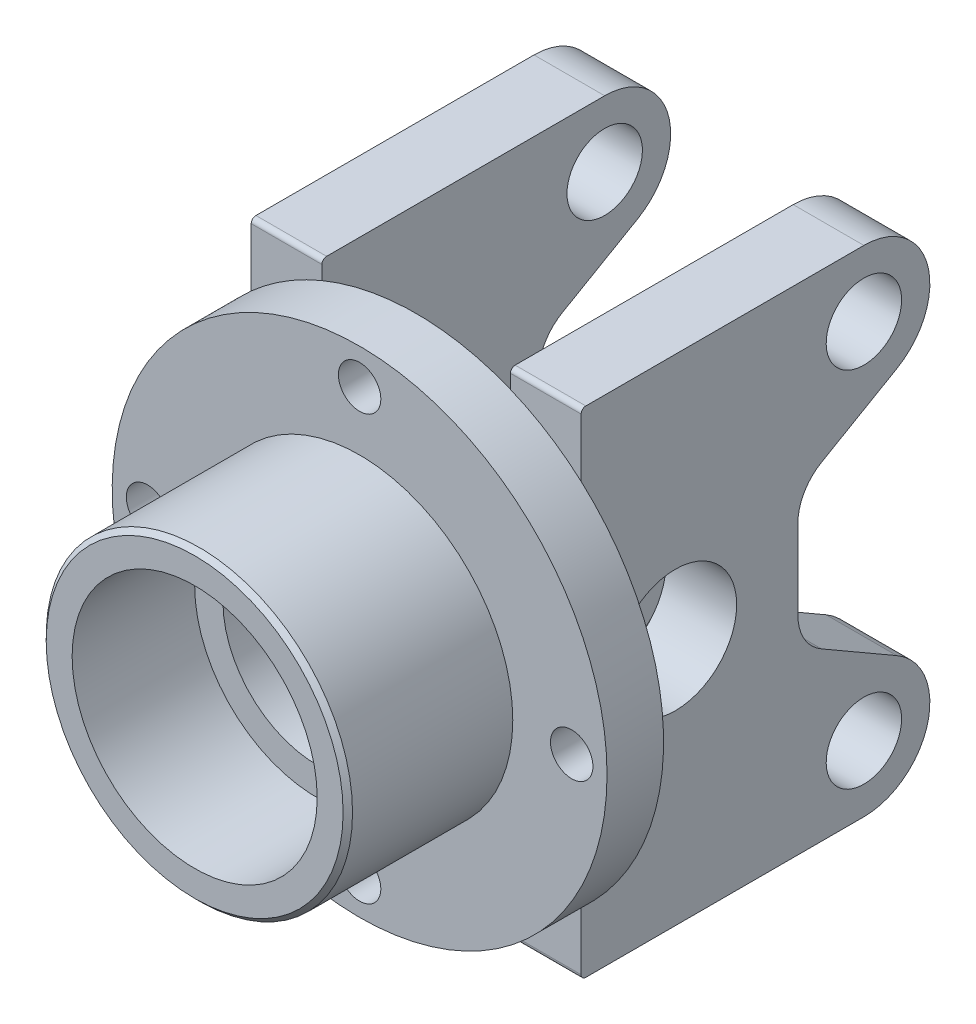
from build123d import *

# Parameters (mm, degrees)
SKETCH_10_R          = 52.5
SKETCH_10_R_2        = 32.5
EXTRUDE_5_DEPTH      = 12
SKETCH_10_3_R        = 32.5
EXTRUDE_6_DEPTH      = 47
SKETCH_11_R          = 26
CUT_EXTRUDE_11_DEPTH = 26
SKETCH_12_R          = 20
CUT_EXTRUDE_12_DEPTH = 21
SKETCH_13_R          = 4.5
CUT_EXTRUDE_13_DEPTH = 88.872066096
SKETCH_14_W          = 15
SKETCH_14_H          = 105
EXTRUDE_8_DEPTH      = 46
SKETCH_17_R          = 13
CUT_EXTRUDE_16_DEPTH = 500
FILLET_1_R           = 1
CHAMFER_1_SIZE       = 1
EXTRUDE_START        = -70
SKETCH_19_R          = 8
EXTRUDE_9_DEPTH      = 70
SKETCH_20_W          = 40
SKETCH_20_H          = 82.970297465
CUT_EXTRUDE_17_DEPTH = 500


with BuildPart() as part:
    # Sketch 10 → Extrude 5 (new body)
    # profile 1 of 2: a face of its own
    with BuildSketch(Plane.XY):
        Circle(SKETCH_10_R)
        Circle(SKETCH_10_R_2, mode=Mode.SUBTRACT)
    # profile 2 of 2: a face of its own
    with BuildSketch(Plane.XY):
        Circle(SKETCH_10_R_2)
    extrude(amount=EXTRUDE_5_DEPTH)

    # Sketch 10_3 → Extrude 6 (add)
    with BuildSketch(Plane.XY):
        Circle(SKETCH_10_3_R)
    extrude(amount=EXTRUDE_6_DEPTH)

    # Sketch 11 → Cut-Extrude 11 (cut)
    with BuildSketch(Plane.XY.offset(47)):
        Circle(SKETCH_11_R)
    extrude(amount=-CUT_EXTRUDE_11_DEPTH, mode=Mode.SUBTRACT)

    # Sketch 12 → Cut-Extrude 12 (cut)
    with BuildSketch(Plane(origin=(0, 0, 0), x_dir=(-1, 0, 0), z_dir=(0, 0, -1))):
        Circle(SKETCH_12_R)
    extrude(amount=-CUT_EXTRUDE_12_DEPTH, mode=Mode.SUBTRACT)

    # Sketch 13 → Cut-Extrude 13 (cut, through all)
    with BuildSketch(Plane(origin=(0, 0, 0), x_dir=(-1, 0, 0), z_dir=(0, 0, -1))):
        with Locations((0, 45)):
            Circle(SKETCH_13_R)
        with Locations((45, 0)):
            Circle(SKETCH_13_R)
        with Locations((0, -45)):
            Circle(SKETCH_13_R)
        with Locations((-45, 0)):
            Circle(SKETCH_13_R)
    extrude(amount=-CUT_EXTRUDE_13_DEPTH, mode=Mode.SUBTRACT)

    # Sketch 14 → Extrude 8 (add)
    with BuildSketch(Plane(origin=(0, 0, 0), x_dir=(-1, 0, 0), z_dir=(0, 0, -1))):
        with Locations((-27.5, 0)):
            Rectangle(SKETCH_14_W, SKETCH_14_H)
        with Locations((27.5, 0)):
            Rectangle(SKETCH_14_W, SKETCH_14_H)
    extrude(amount=EXTRUDE_8_DEPTH)

    # Sketch 17 → Cut-Extrude 16 (cut, symmetric)
    with BuildSketch(Plane(origin=(0, 0, 0), x_dir=(0, 0, -1), z_dir=(1, 0, 0))):
        with Locations(Location((20, 0, 0), (0, 0, 90))):
            Circle(SKETCH_17_R)
    extrude(amount=CUT_EXTRUDE_16_DEPTH, both=True, mode=Mode.SUBTRACT)

    # Fillet 1
    fillet_1_edges = [part.edges().sort_by_distance(p)[0] for p in [
        (27.5, -52.5, 0),
        (27.5, 52.5, 0),
        (-27.5, 52.5, 0),
        (-27.5, -52.5, 0),
    ]]
    fillet(fillet_1_edges, radius=FILLET_1_R)

    # Chamfer 1
    chamfer_1_edges = [part.edges().sort_by_distance(p)[0] for p in [
        (-32.5, 0, 47),
    ]]
    chamfer(chamfer_1_edges, length=CHAMFER_1_SIZE)

    # Sketch 19 → Extrude 9 (add)
    # profile 1 of 2: a face of its own
    with BuildSketch(Plane(origin=(35, 0, 0), x_dir=(0, 0, -1), z_dir=(1, 0, 0)).offset(EXTRUDE_START)):
        with BuildLine():
            Line((51, 17.13804004), (67, 26.375644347))
            ThreePointArc((67, 26.375644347), (73.522961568, 42.123466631), (60, 52.5))
            Line((60, 52.5), (46, 52.5))
            Line((46, 52.5), (46, 8.477786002))
            ThreePointArc((46, 8.477786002), (47.339745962, 13.477786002), (51, 17.13804004))
        make_face()
        with Locations(Location((60, 38.5, 0), (0, 0, 90))):
            Circle(SKETCH_19_R, mode=Mode.SUBTRACT)
    # profile 2 of 2: a face of its own
    with BuildSketch(Plane(origin=(35, 0, 0), x_dir=(0, 0, -1), z_dir=(1, 0, 0)).offset(EXTRUDE_START)):
        with BuildLine():
            ThreePointArc((51, -17.13804004), (47.339745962, -13.477786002), (46, -8.477786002))
            Line((46, -8.477786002), (46, -52.5))
            Line((46, -52.5), (60, -52.5))
            ThreePointArc((60, -52.5), (73.522961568, -42.123466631), (67, -26.375644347))
            Line((67, -26.375644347), (51, -17.13804004))
        make_face()
        with Locations(Location((60, -38.5, 0), (0, 0, 90))):
            Circle(SKETCH_19_R, mode=Mode.SUBTRACT)
    extrude_9 = extrude(amount=EXTRUDE_9_DEPTH)

    # Mirror 1: Extrude 9 across plane
    add(extrude_9.mirror(Plane(origin=(0, 0, 0), x_dir=(0, 0, 1), z_dir=(1, 0, 0))))

    # Sketch 20 → Cut-Extrude 17 (cut, symmetric)
    with BuildSketch(Plane(origin=(0, 0, 0), x_dir=(1, 0, 0), z_dir=(0, 1, 0))):
        with Locations((0, 41.485148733)):
            Rectangle(SKETCH_20_W, SKETCH_20_H)
    extrude(amount=CUT_EXTRUDE_17_DEPTH, both=True, mode=Mode.SUBTRACT)


solid = part.part
